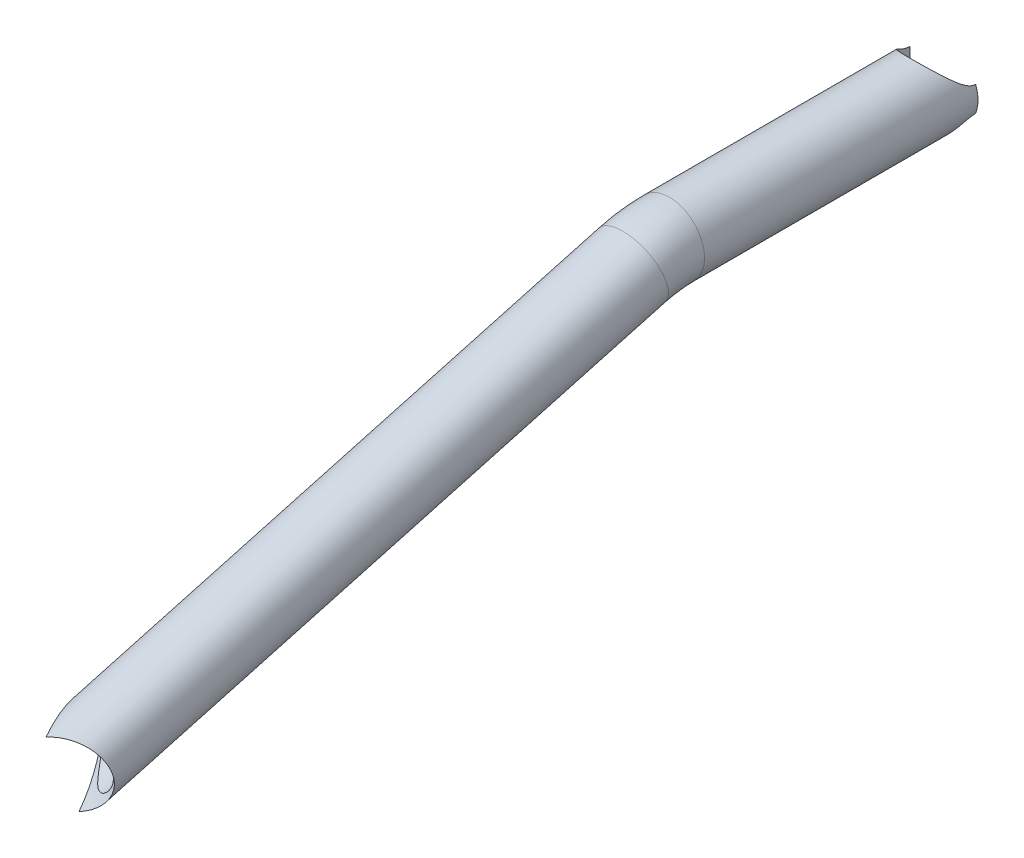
from build123d import *

# Parameters (mm, degrees)
ESQUISSE1_R             = 15
ESQUISSE1_R_2           = 13
ESQUISSE3_R             = 14
ENL_V_MAT_EXTRU_1_DEPTH = 412.216854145
ESQUISSE4_R             = 15
ENL_V_MAT_EXTRU_2_DEPTH = 361.755999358


with BuildPart() as part:
    # Balayage1: sweep along a path in Esquisse2
    with BuildLine(Plane(origin=(109.471848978, 0, 0), x_dir=(0, 0, -1), z_dir=(1, 0, 0))) as balayage1_path:
        Line((0, 163.773719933), (-116.627828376, 163.773719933))
        ThreePointArc((-116.627828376, 163.773719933), (-124.634877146, 163.237046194), (-132.498686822, 161.6366256))
        Line((-132.498686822, 161.6366256), (-375.446400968, 95))
    # Esquisse1 → Balayage1 (sweep)
    with BuildSketch(Plane.XY):
        with Locations((109.471848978, 163.773719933)):
            Circle(ESQUISSE1_R)
        with Locations((109.471848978, 163.773719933)):
            Circle(ESQUISSE1_R_2, mode=Mode.SUBTRACT)
    sweep(path=balayage1_path.line)

    # Esquisse3 → Enl_v. mat.-Extru.1 (cut, through all)
    with BuildSketch(Plane(origin=(0, 178.773719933, 0), x_dir=(1, 0, 0), z_dir=(0, 1, 0))):
        with Locations((109.471848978, 0)):
            Circle(ESQUISSE3_R)
    extrude(amount=-ENL_V_MAT_EXTRU_1_DEPTH, mode=Mode.SUBTRACT)

    # Esquisse4 → Enl_v. mat.-Extru.2 (cut, through all)
    with BuildSketch(Plane(origin=(296.428710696, 0, 239.579368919), x_dir=(0.6285850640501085, 0, -0.7777408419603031), z_dir=(0.7777408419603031, 0, 0.6285850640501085))):
        with Locations((-223.187630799, 95)):
            Circle(ESQUISSE4_R)
    extrude(amount=-ENL_V_MAT_EXTRU_2_DEPTH, mode=Mode.SUBTRACT)


solid = part.part
